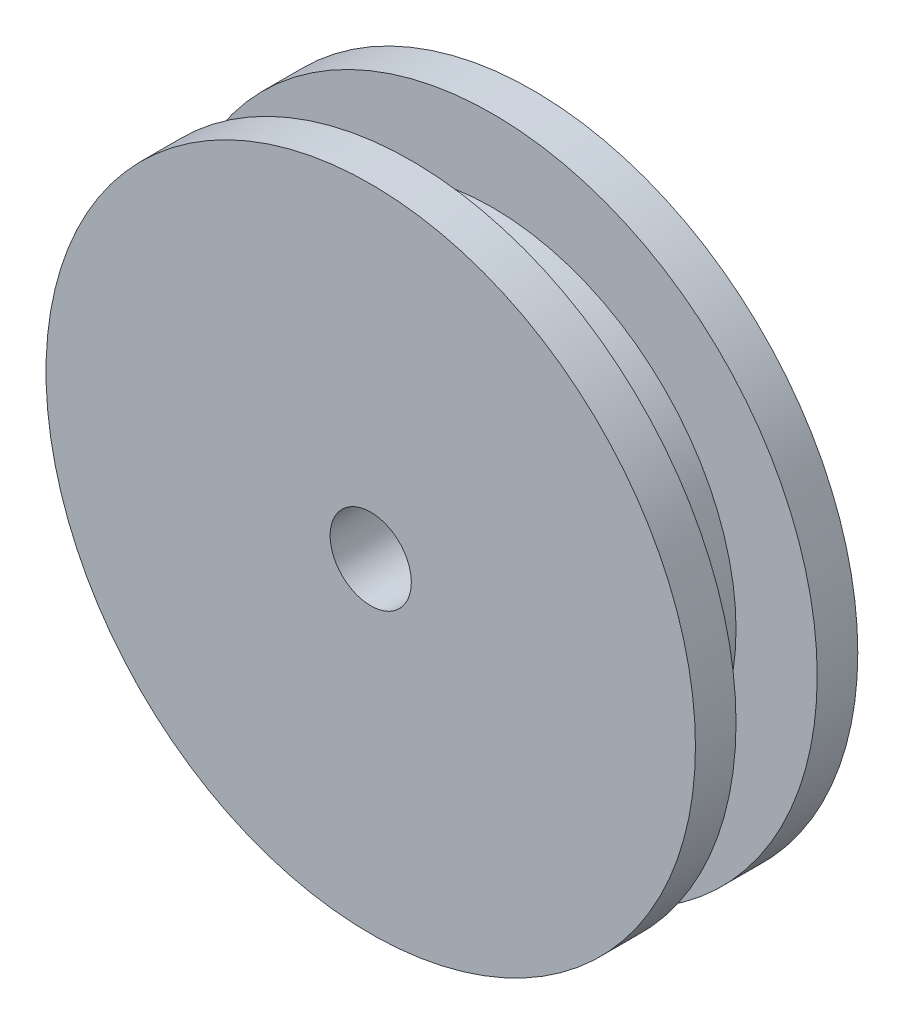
from build123d import *

# Parameters (mm, degrees)
SKETCH3_R          = 3.175
CUT_EXTRUDE1_DEPTH = 40.940692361
SKETCH4_R          = 0.9921875
CUT_EXTRUDE2_DEPTH = 38.600633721


with BuildPart() as part:
    # Sketch2 → Revolve1 (revolve)
    with BuildSketch(Plane(origin=(0, 0, 0), x_dir=(0, 0, -1), z_dir=(1, 0, 0)), mode=Mode.PRIVATE) as revolve1_sk:
        Polygon((-6.35, 0), (6.35, 0), (11.1125, 0), (11.1125, 6.35), (6.35, 6.35), (6.35, 25.4), (3.175, 25.4), (3.175, 19.05), (-3.175, 19.05), (-3.175, 25.4), (-6.35, 25.4), align=None)
    revolve(revolve1_sk.sketch.rotate(Axis((0, 0, 6.35), (0, 0, -1)), 90), axis=Axis((0, 0, 6.35), (0, 0, -1)))

    # Sketch3 → Cut-Extrude1 (cut, through all)
    with BuildSketch(Plane.XY.offset(6.35)):
        Circle(SKETCH3_R)
    extrude(amount=-CUT_EXTRUDE1_DEPTH, mode=Mode.SUBTRACT)

    # Sketch4 → Cut-Extrude2 (cut, through all)
    with BuildSketch(Plane(origin=(0, 0, 0), x_dir=(1, 0, 0), z_dir=(0, 1, 0))):
        with Locations(Location((0, 8.73125, 0), (0, 0, 90))):
            Circle(SKETCH4_R)
    extrude(amount=CUT_EXTRUDE2_DEPTH, mode=Mode.SUBTRACT)


solid = part.part
